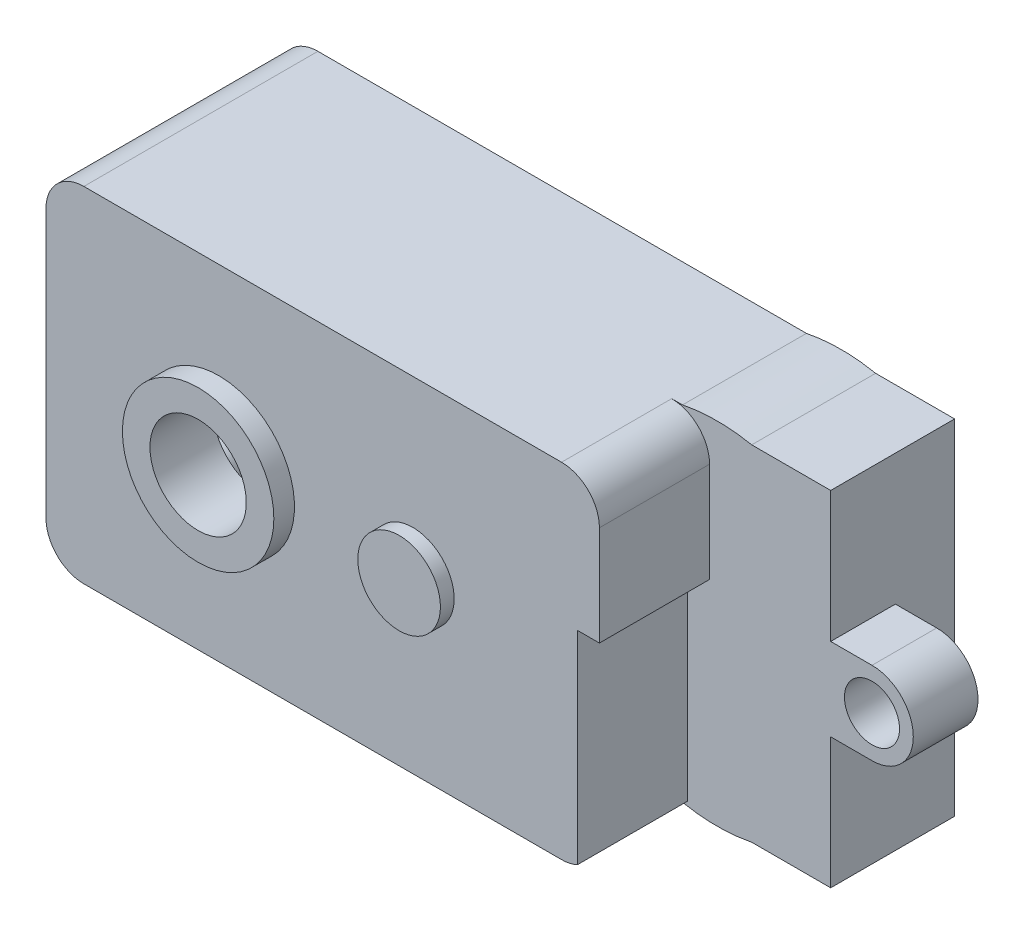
from build123d import *

# Parameters (mm, degrees)
EXTRUSION3_DEPTH         = 9
EXTRUSION4_DEPTH         = 8
ESQUISSE6_W              = 3.665283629
ESQUISSE6_H              = 15
ENL_V_MAT_EXTRU_2_DEPTH  = 8
COQUE1_T                 = -1
COQUE1_THICKNESS_2_DEPTH = 0.5
CONG_2_R                 = 2.75
ESQUISSE8_R              = 3
EXTRUSION5_DEPTH         = 0.9
EXTRUSION6_START         = 1
ESQUISSE9_R              = 3
EXTRUSION6_DEPTH         = 1
ESQUISSE10_R             = 1.525
ENL_V_MAT_EXTRU_3_DEPTH  = 2.8
ESQUISSE11_R             = 5.5
EXTRUSION7_DEPTH         = 1.6
EXTRUSION8_START         = 1.5
ESQUISSE13_R             = 5.5
EXTRUSION8_DEPTH         = 1.5
ESQUISSE12_R             = 3.5
ENL_V_MAT_EXTRU_4_DEPTH  = 57.848680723
ESQUISSE14_R             = 0.75
EXTRUSION9_DEPTH         = 14.2
ESQUISSE15_R             = 1.25
EXTRUSION10_DEPTH        = 4.7
ESQUISSE16_R             = 2
ENL_V_MAT_EXTRU_5_DEPTH  = 4


with BuildPart() as part:
    # Esquisse3 → Extrusion3 (new body)
    with BuildSketch(Plane.XY):
        with BuildLine():
            Line((-5.737531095, 0), (0, 0))
            Line((0, 0), (0, 25))
            Line((0, 25), (-5.737531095, 25))
            ThreePointArc((-5.737531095, 25), (-8.25, 25.25), (-10.762468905, 25))
            Line((-10.762468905, 25), (-49, 25))
            Line((-49, 25), (-49, 0))
            Line((-49, 0), (-10.762468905, 0))
            ThreePointArc((-10.762468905, 0), (-8.25, -0.25), (-5.737531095, 0))
        make_face()
    extrude(amount=EXTRUSION3_DEPTH)

    # Esquisse5 → Extrusion4 (add)
    with BuildSketch(Plane.XY.offset(9)):
        with BuildLine():
            Line((-11.55, 0), (-49, 0))
            Line((-49, 0), (-49, 25))
            Line((-49, 25), (-11.55, 25))
            ThreePointArc((-11.55, 25), (-9.605456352, 24.194543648), (-8.8, 22.25))
            Line((-8.8, 22.25), (-8.8, 2.75))
            ThreePointArc((-8.8, 2.75), (-9.605456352, 0.805456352), (-11.55, 0))
        make_face()
    extrude(amount=EXTRUSION4_DEPTH)

    # Esquisse6 → Enl_v. mat.-Extru.2 (cut)
    with BuildSketch(Plane.XY.offset(17)):
        with Locations((-8.567358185, 7.5)):
            Rectangle(ESQUISSE6_W, ESQUISSE6_H)
    extrude(amount=-ENL_V_MAT_EXTRU_2_DEPTH, mode=Mode.SUBTRACT)

    # Coque1
    coque1_openings = [part.faces().sort_by_distance(p)[0] for p in [
        (-24.47776741, 12.5, 0),
    ]]
    offset(amount=COQUE1_T, openings=coque1_openings, kind=Kind.INTERSECTION)

    # Coque1 thickness 2 face (on inner face of the shell) → Coque1 thickness 2 (add)
    with BuildSketch(Plane(origin=(-29.428726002, 12.603874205, 16), x_dir=(1, 0, 0), z_dir=(0, 0, 1))):
        with BuildLine():
            Line((18.028726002, 3.396125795), (18.028726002, -11.597433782))
            ThreePointArc((18.028726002, -11.597433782), (17.953795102, -11.602263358), (17.878726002, -11.603874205))
            Line((17.878726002, -11.603874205), (-18.571273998, -11.603874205))
            Line((-18.571273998, -11.603874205), (-18.571273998, 11.396125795))
            Line((-18.571273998, 11.396125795), (17.878726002, 11.396125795))
            ThreePointArc((17.878726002, 11.396125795), (19.116162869, 10.883562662), (19.628726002, 9.646125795))
            Line((19.628726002, 9.646125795), (19.628726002, 3.396125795))
            Line((19.628726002, 3.396125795), (18.028726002, 3.396125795))
        make_face()
    extrude(amount=-COQUE1_THICKNESS_2_DEPTH)

    # Cong_2
    cong_2_edges = [part.edges().sort_by_distance(p)[0] for p in [
        (-49, 0, 8.5),
        (-49, 25, 8.5),
    ]]
    fillet(cong_2_edges, radius=CONG_2_R)

    # Esquisse8 → Extrusion5 (add)
    with BuildSketch(Plane(origin=(0, 0, 15.5), x_dir=(-1, 0, 0), z_dir=(0, 0, -1))):
        with Locations((22.35, 12.5)):
            Circle(ESQUISSE8_R)
    extrude(amount=EXTRUSION5_DEPTH)

    # Esquisse9 → Extrusion6 (add)
    with BuildSketch(Plane.XY.offset(17).offset(EXTRUSION6_START)):
        with Locations(Location((-22.35, 12.5, 0), (0, 0, 180))):
            Circle(ESQUISSE9_R)
    extrude(amount=-EXTRUSION6_DEPTH)

    # Esquisse10 → Enl_v. mat.-Extru.3 (cut)
    with BuildSketch(Plane(origin=(0, 0, 14.6), x_dir=(-1, 0, 0), z_dir=(0, 0, -1))):
        with Locations((22.35, 12.5)):
            Circle(ESQUISSE10_R)
    extrude(amount=-ENL_V_MAT_EXTRU_3_DEPTH, mode=Mode.SUBTRACT)

    # Esquisse11 → Extrusion7 (add)
    with BuildSketch(Plane(origin=(0, 0, 15.5), x_dir=(-1, 0, 0), z_dir=(0, 0, -1))):
        with Locations((36.45, 12.5)):
            Circle(ESQUISSE11_R)
    extrude(amount=EXTRUSION7_DEPTH)

    # Esquisse13 → Extrusion8 (add)
    with BuildSketch(Plane.XY.offset(17).offset(EXTRUSION8_START)):
        with Locations(Location((-36.45, 12.5, 0), (0, 0, 180))):
            Circle(ESQUISSE13_R)
    extrude(amount=-EXTRUSION8_DEPTH)

    # Esquisse12 → Enl_v. mat.-Extru.4 (cut, through all)
    with BuildSketch(Plane(origin=(0, 0, 13.9), x_dir=(-1, 0, 0), z_dir=(0, 0, -1))):
        with Locations((36.45, 12.5)):
            Circle(ESQUISSE12_R)
    extrude(amount=-ENL_V_MAT_EXTRU_4_DEPTH, mode=Mode.SUBTRACT)

    # Esquisse14 → Extrusion9 (add)
    # profile 1 of 2: a face of its own
    with BuildSketch(Plane(origin=(0, 0, 15.5), x_dir=(-1, 0, 0), z_dir=(0, 0, -1))):
        with BuildLine():
            Line((48, 1), (46.25, 1))
            ThreePointArc((46.25, 1), (45.012563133, 3.987436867), (48, 2.75))
            Line((48, 2.75), (48, 1))
        make_face()
        with Locations((46.25, 2.75)):
            Circle(ESQUISSE14_R, mode=Mode.SUBTRACT)
    # profile 2 of 2: a face of its own
    with BuildSketch(Plane(origin=(0, 0, 15.5), x_dir=(-1, 0, 0), z_dir=(0, 0, -1))):
        with BuildLine():
            Line((48, 24), (48, 22.25))
            ThreePointArc((48, 22.25), (45.012563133, 21.012563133), (46.25, 24))
            Line((46.25, 24), (48, 24))
        make_face()
        with Locations((46.25, 22.25)):
            Circle(ESQUISSE14_R, mode=Mode.SUBTRACT)
    extrude(amount=EXTRUSION9_DEPTH)

    # Esquisse15 → Extrusion10 (add)
    with BuildSketch(Plane.XY.offset(9)):
        with BuildLine():
            Line((3, 15.5), (-2.647128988, 15.5))
            Line((-2.647128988, 15.5), (-2.647128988, 9.5))
            Line((-2.647128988, 9.5), (3, 9.5))
            ThreePointArc((3, 9.5), (6, 12.5), (3, 15.5))
        make_face()
        with Locations((3, 12.5)):
            Circle(ESQUISSE15_R, mode=Mode.SUBTRACT)
    extrude(amount=-EXTRUSION10_DEPTH)

    # Esquisse16 → Enl_v. mat.-Extru.5 (cut)
    with BuildSketch(Plane.XY.offset(9)):
        with Locations((3, 12.5)):
            Circle(ESQUISSE16_R)
    extrude(amount=-ENL_V_MAT_EXTRU_5_DEPTH, mode=Mode.SUBTRACT)


solid = part.part
